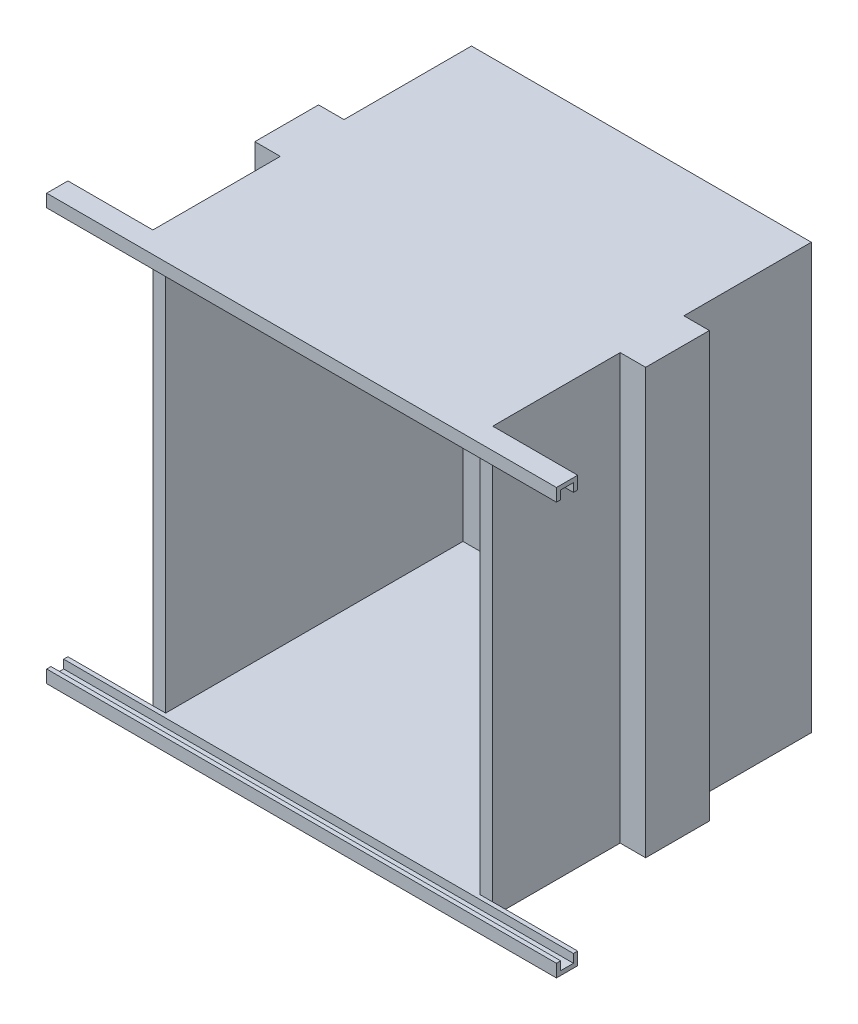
from build123d import *

# Parameters (mm, degrees)
ESQUISSE1_W             = 80
ESQUISSE1_H             = 100
BOSS_EXTRU_1_DEPTH      = 5
ESQUISSE2_W             = 80
ESQUISSE2_H             = 100
ESQUISSE2_W_2           = 74
ESQUISSE2_H_2           = 94
BOSS_EXTRU_2_DEPTH      = 70
ESQUISSE3_W             = 80
ESQUISSE3_H             = 3
BOSS_EXTRU_3_DEPTH      = 5
ESQUISSE4_W             = 5
ESQUISSE4_H             = 3
BOSS_EXTRU_4_DEPTH      = 20
ESQUISSE5_W             = 5
ESQUISSE5_H             = 3
BOSS_EXTRU_5_DEPTH      = 20
ESQUISSE6_W             = 3
ESQUISSE6_H             = 2
ENL_V_MAT_EXTRU_1_DEPTH = 176.499287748
ESQUISSE7_W             = 6
ESQUISSE7_H             = 15
BOSS_EXTRU_6_DEPTH      = 100


with BuildPart() as part:
    # Esquisse1 → Boss.-Extru.1 (new body)
    with BuildSketch(Plane.XY):
        with Locations((40, 50)):
            Rectangle(ESQUISSE1_W, ESQUISSE1_H)
    extrude(amount=BOSS_EXTRU_1_DEPTH)

    # Esquisse2 → Boss.-Extru.2 (add)
    with BuildSketch(Plane.XY.offset(5)):
        with Locations((40, 50)):
            Rectangle(ESQUISSE2_W, ESQUISSE2_H)
        with Locations((40, 50)):
            Rectangle(ESQUISSE2_W_2, ESQUISSE2_H_2, mode=Mode.SUBTRACT)
    extrude(amount=BOSS_EXTRU_2_DEPTH)

    # Esquisse3 → Boss.-Extru.3 (add)
    with BuildSketch(Plane.XY.offset(75)):
        with Locations((40, 98.5)):
            Rectangle(ESQUISSE3_W, ESQUISSE3_H)
        with Locations((40, 1.5)):
            Rectangle(ESQUISSE3_W, ESQUISSE3_H)
    extrude(amount=BOSS_EXTRU_3_DEPTH)

    # Esquisse4 → Boss.-Extru.4 (add)
    with BuildSketch(Plane(origin=(80, 0, 0), x_dir=(0, 0, -1), z_dir=(1, 0, 0))):
        with Locations((-77.5, 98.5)):
            Rectangle(ESQUISSE4_W, ESQUISSE4_H)
        with Locations((-77.5, 1.5)):
            Rectangle(ESQUISSE4_W, ESQUISSE4_H)
    extrude(amount=BOSS_EXTRU_4_DEPTH)

    # Esquisse5 → Boss.-Extru.5 (add)
    with BuildSketch(Plane.ZY):
        with Locations((77.5, 98.5)):
            Rectangle(ESQUISSE5_W, ESQUISSE5_H)
        with Locations((77.5, 1.5)):
            Rectangle(ESQUISSE5_W, ESQUISSE5_H)
    extrude(amount=BOSS_EXTRU_5_DEPTH)

    # Esquisse6 → Enl_v. mat.-Extru.1 (cut, through all)
    with BuildSketch(Plane.ZY.offset(20)):
        with Locations((77.5, 2)):
            Rectangle(ESQUISSE6_W, ESQUISSE6_H)
        with Locations((77.5, 98)):
            Rectangle(ESQUISSE6_W, ESQUISSE6_H)
    extrude(amount=-ENL_V_MAT_EXTRU_1_DEPTH, mode=Mode.SUBTRACT)

    # Esquisse7 → Boss.-Extru.6 (add)
    with BuildSketch(Plane(origin=(0, 100, 0), x_dir=(1, 0, 0), z_dir=(0, 1, 0))):
        with Locations((-3, -37.5)):
            Rectangle(ESQUISSE7_W, ESQUISSE7_H)
        with Locations((83, -37.5)):
            Rectangle(ESQUISSE7_W, ESQUISSE7_H)
    extrude(amount=-BOSS_EXTRU_6_DEPTH)


solid = part.part
